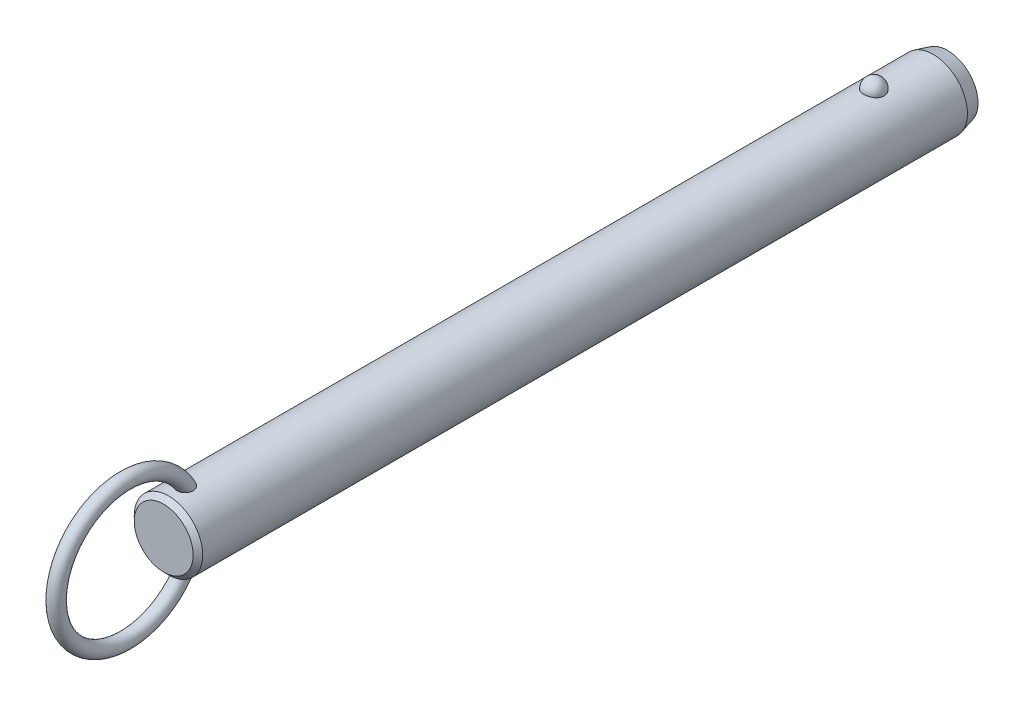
ISO-10303-21;
HEADER;
FILE_DESCRIPTION(('STEP AP214'),'2;1');
FILE_NAME('part.step','',(''),(''),'','','');
FILE_SCHEMA(('AUTOMOTIVE_DESIGN { 1 0 10303 214 1 1 1 1 }'));
ENDSEC;
DATA;
#1=APPLICATION_CONTEXT('core data for automotive mechanical design processes');
#2=APPLICATION_PROTOCOL_DEFINITION('international standard','automotive_design',2000,#1);
#3=PRODUCT_CONTEXT('',#1,'mechanical');
#4=PRODUCT('Part','Part','',(#3));
#5=PRODUCT_RELATED_PRODUCT_CATEGORY('part','',(#4));
#6=PRODUCT_DEFINITION_FORMATION('','',#4);
#7=PRODUCT_DEFINITION_CONTEXT('part definition',#1,'design');
#8=PRODUCT_DEFINITION('design','',#6,#7);
#9=PRODUCT_DEFINITION_SHAPE('','',#8);
#10=(LENGTH_UNIT() NAMED_UNIT(*) SI_UNIT(.MILLI.,.METRE.));
#11=(NAMED_UNIT(*) PLANE_ANGLE_UNIT() SI_UNIT($,.RADIAN.));
#12=(NAMED_UNIT(*) SI_UNIT($,.STERADIAN.) SOLID_ANGLE_UNIT());
#13=UNCERTAINTY_MEASURE_WITH_UNIT(LENGTH_MEASURE(1.E-05),#10,'distance_accuracy_value','');
#14=(GEOMETRIC_REPRESENTATION_CONTEXT(3) GLOBAL_UNCERTAINTY_ASSIGNED_CONTEXT((#13)) GLOBAL_UNIT_ASSIGNED_CONTEXT((#10,
#11,#12)) REPRESENTATION_CONTEXT('',''));
#15=CARTESIAN_POINT('',(0.,0.,0.));
#16=DIRECTION('',(0.,0.,1.));
#17=DIRECTION('',(1.,0.,0.));
#18=AXIS2_PLACEMENT_3D('',#15,#16,#17);
#19=CARTESIAN_POINT('',(0.,0.,137.2));
#20=DIRECTION('',(0.,0.,-1.));
#21=DIRECTION('',(-1.,0.,0.));
#22=AXIS2_PLACEMENT_3D('',#19,#20,#21);
#23=CYLINDRICAL_SURFACE('',#22,7.1);
#24=CARTESIAN_POINT('',(2.0769088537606,6.78943661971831,-2.1));
#25=CARTESIAN_POINT('',(2.07690739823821,6.78943796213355,-1.98268154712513));
#26=CARTESIAN_POINT('',(2.06738130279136,6.79237331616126,-1.86534506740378));
#27=CARTESIAN_POINT('',(2.0295040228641,6.8037853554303,-1.63400788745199));
#28=CARTESIAN_POINT('',(2.00114757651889,6.81226358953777,-1.52000812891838));
#29=CARTESIAN_POINT('',(1.92632025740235,6.83379798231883,-1.29863433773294));
#30=CARTESIAN_POINT('',(1.87985726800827,6.84685214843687,-1.19125744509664));
#31=CARTESIAN_POINT('',(1.76995205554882,6.87608091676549,-0.98604657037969));
#32=CARTESIAN_POINT('',(1.70650980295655,6.8922555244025,-0.88821260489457));
#33=CARTESIAN_POINT('',(1.5638119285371,6.92602930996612,-0.704242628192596));
#34=CARTESIAN_POINT('',(1.4844714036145,6.94363582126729,-0.618173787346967));
#35=CARTESIAN_POINT('',(1.31221746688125,6.97823658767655,-0.460740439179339));
#36=CARTESIAN_POINT('',(1.21930409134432,6.99523084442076,-0.389375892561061));
#37=CARTESIAN_POINT('',(1.02268781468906,7.02666176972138,-0.263547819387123));
#38=CARTESIAN_POINT('',(0.91902009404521,7.04110638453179,-0.209031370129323));
#39=CARTESIAN_POINT('',(0.703548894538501,7.06588726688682,-0.118163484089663));
#40=CARTESIAN_POINT('',(0.591746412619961,7.07622403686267,-0.0818098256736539));
#41=CARTESIAN_POINT('',(0.365557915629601,7.09147068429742,-0.0288711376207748));
#42=CARTESIAN_POINT('',(0.251267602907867,7.09648447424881,-0.0119070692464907));
#43=CARTESIAN_POINT('',(0.0213499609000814,7.10089837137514,0.00304925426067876));
#44=CARTESIAN_POINT('',(-0.0942772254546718,7.10029907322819,0.00104351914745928));
#45=CARTESIAN_POINT('',(-0.321651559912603,7.09360829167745,-0.0216931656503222));
#46=CARTESIAN_POINT('',(-0.433431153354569,7.08760388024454,-0.0421272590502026));
#47=CARTESIAN_POINT('',(-0.651862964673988,7.07086131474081,-0.100729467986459));
#48=CARTESIAN_POINT('',(-0.758515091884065,7.06012307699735,-0.138897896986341));
#49=CARTESIAN_POINT('',(-0.964449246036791,7.03496097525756,-0.232213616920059));
#50=CARTESIAN_POINT('',(-1.06368095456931,7.02051445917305,-0.287465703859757));
#51=CARTESIAN_POINT('',(-1.25145353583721,6.98948740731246,-0.413383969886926));
#52=CARTESIAN_POINT('',(-1.33999321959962,6.97290663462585,-0.48405186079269));
#53=CARTESIAN_POINT('',(-1.50591604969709,6.93898770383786,-0.640594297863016));
#54=CARTESIAN_POINT('',(-1.58302488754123,6.92164094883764,-0.726757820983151));
#55=CARTESIAN_POINT('',(-1.72189320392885,6.8884103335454,-0.91092752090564));
#56=CARTESIAN_POINT('',(-1.78365144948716,6.87252659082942,-1.008934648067));
#57=CARTESIAN_POINT('',(-1.89101272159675,6.84377189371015,-1.21549497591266));
#58=CARTESIAN_POINT('',(-1.93639553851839,6.83094274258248,-1.32416860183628));
#59=CARTESIAN_POINT('',(-2.00874275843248,6.81002070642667,-1.54791500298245));
#60=CARTESIAN_POINT('',(-2.03570774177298,6.80192767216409,-1.66298757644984));
#61=CARTESIAN_POINT('',(-2.07047276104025,6.7914266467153,-1.89571453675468));
#62=CARTESIAN_POINT('',(-2.07835878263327,6.78899315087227,-2.01335491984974));
#63=CARTESIAN_POINT('',(-2.07502083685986,6.79001409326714,-2.24833570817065));
#64=CARTESIAN_POINT('',(-2.06379746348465,6.7934683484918,-2.36567612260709));
#65=CARTESIAN_POINT('',(-2.02263913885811,6.80583442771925,-2.59603194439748));
#66=CARTESIAN_POINT('',(-1.99281127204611,6.81471501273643,-2.70906820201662));
#67=CARTESIAN_POINT('',(-1.91526639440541,6.83691232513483,-2.92836575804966));
#68=CARTESIAN_POINT('',(-1.8675486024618,6.85022924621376,-3.03462676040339));
#69=CARTESIAN_POINT('',(-1.75504492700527,6.87991336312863,-3.23806487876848));
#70=CARTESIAN_POINT('',(-1.69015924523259,6.89629822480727,-3.33518422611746));
#71=CARTESIAN_POINT('',(-1.54505404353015,6.93024852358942,-3.51697105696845));
#72=CARTESIAN_POINT('',(-1.46483385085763,6.94781401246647,-3.60163799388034));
#73=CARTESIAN_POINT('',(-1.29071406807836,6.98225977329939,-3.75654119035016));
#74=CARTESIAN_POINT('',(-1.19675650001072,6.99913673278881,-3.82671308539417));
#75=CARTESIAN_POINT('',(-0.997940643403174,7.03023618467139,-3.9501837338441));
#76=CARTESIAN_POINT('',(-0.89308318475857,7.04445887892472,-4.00348377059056));
#77=CARTESIAN_POINT('',(-0.676902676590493,7.06848365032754,-4.09107242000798));
#78=CARTESIAN_POINT('',(-0.565686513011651,7.0783430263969,-4.12560889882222));
#79=CARTESIAN_POINT('',(-0.338739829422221,7.09282534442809,-4.17575450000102));
#80=CARTESIAN_POINT('',(-0.223009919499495,7.09744899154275,-4.19136617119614));
#81=CARTESIAN_POINT('',(0.00707628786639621,7.10090930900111,-4.20307965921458));
#82=CARTESIAN_POINT('',(0.121410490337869,7.09986531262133,-4.19958377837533));
#83=CARTESIAN_POINT('',(0.347815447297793,7.092380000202,-4.17411564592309));
#84=CARTESIAN_POINT('',(0.459886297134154,7.08593891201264,-4.15214417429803));
#85=CARTESIAN_POINT('',(0.678084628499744,7.06838983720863,-4.09049562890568));
#86=CARTESIAN_POINT('',(0.784237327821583,7.05730369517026,-4.05090137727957));
#87=CARTESIAN_POINT('',(0.988305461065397,7.03163139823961,-3.95511447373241));
#88=CARTESIAN_POINT('',(1.08622031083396,7.01704499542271,-3.89892064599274));
#89=CARTESIAN_POINT('',(1.27284490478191,6.98562668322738,-3.77035541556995));
#90=CARTESIAN_POINT('',(1.36137372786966,6.96876135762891,-3.69772964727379));
#91=CARTESIAN_POINT('',(1.52509486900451,6.93477412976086,-3.53878279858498));
#92=CARTESIAN_POINT('',(1.60028496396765,6.91765218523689,-3.45245943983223));
#93=CARTESIAN_POINT('',(1.73681688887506,6.88465753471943,-3.26658774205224));
#94=CARTESIAN_POINT('',(1.79785966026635,6.86881574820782,-3.16681408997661));
#95=CARTESIAN_POINT('',(1.90265327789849,6.84053157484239,-2.95814408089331));
#96=CARTESIAN_POINT('',(1.94640861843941,6.82808830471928,-2.84925010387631));
#97=CARTESIAN_POINT('',(2.01274378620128,6.80881460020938,-2.63454318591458));
#98=CARTESIAN_POINT('',(2.03676193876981,6.80160856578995,-2.52920574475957));
#99=CARTESIAN_POINT('',(2.06884490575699,6.79191902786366,-2.3159172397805));
#100=CARTESIAN_POINT('',(2.07691019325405,6.78943538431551,-2.20796625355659));
#101=CARTESIAN_POINT('',(2.0769088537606,6.78943661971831,-2.1));
#102=B_SPLINE_CURVE_WITH_KNOTS('',3,(#24,#25,#26,#27,#28,#29,#30,#31,#32,#33,#34,#35,#36,#37,
#38,#39,#40,#41,#42,#43,#44,#45,#46,#47,#48,#49,#50,#51,#52,#53,#54,#55,#56,#57,#58,#59,#60,#61,
#62,#63,#64,#65,#66,#67,#68,#69,#70,#71,#72,#73,#74,#75,#76,#77,#78,#79,#80,#81,#82,#83,#84,#85,
#86,#87,#88,#89,#90,#91,#92,#93,#94,#95,#96,#97,#98,#99,#100,#101),.UNSPECIFIED.,.T.,.F.,(4,2,2,
2,2,2,2,2,2,2,2,2,2,2,2,2,2,2,2,2,2,2,2,2,2,2,2,2,2,2,2,2,2,2,2,2,2,2,4),(0.,0.351568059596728,
0.703234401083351,1.05474780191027,1.40626181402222,1.75970563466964,2.11314851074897,
2.4654696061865,2.81774759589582,3.16301449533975,3.50824481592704,3.84801136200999,
4.18778391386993,4.52968352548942,4.87162112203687,5.22076181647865,5.56993054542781,
5.92363364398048,6.27732559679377,6.62942052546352,6.98150450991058,7.33158042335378,
7.68167162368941,8.03384443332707,8.38603269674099,8.73975272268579,9.09344583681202,
9.44234545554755,9.79119807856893,10.1327344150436,10.4742563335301,10.8141898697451,
11.1541474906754,11.4997793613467,11.8454687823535,12.1979079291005,12.5502553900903,
12.8738073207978,13.1973496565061),.UNSPECIFIED.);
#103=CARTESIAN_POINT('',(2.0769088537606,6.78943661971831,-2.1));
#104=VERTEX_POINT('',#103);
#105=EDGE_CURVE('E41',#104,#104,#102,.T.);
#106=ORIENTED_EDGE('',*,*,#105,.T.);
#107=EDGE_LOOP('',(#106));
#108=FACE_BOUND('',#107,.T.);
#109=CARTESIAN_POINT('',(0.,0.,144.12));
#110=DIRECTION('',(0.,0.,1.));
#111=DIRECTION('',(1.,0.,0.));
#112=AXIS2_PLACEMENT_3D('',#109,#110,#111);
#113=CIRCLE('',#112,7.1);
#114=CARTESIAN_POINT('',(7.1,0.,144.12));
#115=VERTEX_POINT('',#114);
#116=EDGE_CURVE('E10',#115,#115,#113,.F.);
#117=ORIENTED_EDGE('',*,*,#116,.T.);
#118=EDGE_LOOP('',(#117));
#119=FACE_BOUND('',#118,.T.);
#120=CARTESIAN_POINT('',(-0.429539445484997,-7.08699541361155,138.942921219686));
#121=CARTESIAN_POINT('',(-0.508331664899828,-7.08221999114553,138.966876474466));
#122=CARTESIAN_POINT('',(-0.585039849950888,-7.07624016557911,138.997457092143));
#123=CARTESIAN_POINT('',(-0.73208265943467,-7.06254296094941,139.071024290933));
#124=CARTESIAN_POINT('',(-0.802417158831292,-7.05482554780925,139.114011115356));
#125=CARTESIAN_POINT('',(-0.934722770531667,-7.03851844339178,139.211113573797));
#126=CARTESIAN_POINT('',(-0.996700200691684,-7.02992941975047,139.265220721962));
#127=CARTESIAN_POINT('',(-1.11079942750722,-7.01280697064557,139.382967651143));
#128=CARTESIAN_POINT('',(-1.16292136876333,-7.00427354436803,139.446607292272));
#129=CARTESIAN_POINT('',(-1.25705660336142,-6.98799959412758,139.582687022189));
#130=CARTESIAN_POINT('',(-1.29888032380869,-6.98027525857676,139.655259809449));
#131=CARTESIAN_POINT('',(-1.37069920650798,-6.96652886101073,139.806168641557));
#132=CARTESIAN_POINT('',(-1.40069157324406,-6.96050720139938,139.884506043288));
#133=CARTESIAN_POINT('',(-1.45043507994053,-6.95031881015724,140.050190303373));
#134=CARTESIAN_POINT('',(-1.46937115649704,-6.94630231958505,140.137789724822));
#135=CARTESIAN_POINT('',(-1.49424917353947,-6.94099239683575,140.314871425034));
#136=CARTESIAN_POINT('',(-1.50018601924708,-6.93970003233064,140.404354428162));
#137=CARTESIAN_POINT('',(-1.49978214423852,-6.93978815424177,140.594060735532));
#138=CARTESIAN_POINT('',(-1.49187639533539,-6.94150934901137,140.694279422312));
#139=CARTESIAN_POINT('',(-1.46177925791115,-6.94790814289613,140.892479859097));
#140=CARTESIAN_POINT('',(-1.43957541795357,-6.95258831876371,140.990459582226));
#141=CARTESIAN_POINT('',(-1.37783293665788,-6.96510647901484,141.19536292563));
#142=CARTESIAN_POINT('',(-1.33634073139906,-6.97328848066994,141.301680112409));
#143=CARTESIAN_POINT('',(-1.23686994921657,-6.99161706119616,141.506177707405));
#144=CARTESIAN_POINT('',(-1.17889192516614,-7.00176357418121,141.604358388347));
#145=CARTESIAN_POINT('',(-1.0587512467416,-7.02082898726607,141.772374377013));
#146=CARTESIAN_POINT('',(-0.999247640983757,-7.02963746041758,141.844123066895));
#147=CARTESIAN_POINT('',(-0.869494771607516,-7.04686074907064,141.977195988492));
#148=CARTESIAN_POINT('',(-0.799263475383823,-7.05527619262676,142.038537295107));
#149=CARTESIAN_POINT('',(-0.665408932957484,-7.06899457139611,142.135131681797));
#150=CARTESIAN_POINT('',(-0.603817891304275,-7.07457275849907,142.173151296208));
#151=CARTESIAN_POINT('',(-0.475172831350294,-7.08437420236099,142.238758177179));
#152=CARTESIAN_POINT('',(-0.408123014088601,-7.08859848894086,142.266353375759));
#153=CARTESIAN_POINT('',(-0.269431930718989,-7.09522749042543,142.309256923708));
#154=CARTESIAN_POINT('',(-0.197757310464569,-7.09761688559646,142.324461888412));
#155=CARTESIAN_POINT('',(-0.0527849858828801,-7.10017268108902,142.340716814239));
#156=CARTESIAN_POINT('',(0.020511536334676,-7.10034065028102,142.341776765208));
#157=CARTESIAN_POINT('',(0.156426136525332,-7.09855986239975,142.330461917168));
#158=CARTESIAN_POINT('',(0.219199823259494,-7.09688191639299,142.319806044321));
#159=CARTESIAN_POINT('',(0.342134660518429,-7.09201880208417,142.288537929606));
#160=CARTESIAN_POINT('',(0.402295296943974,-7.08883333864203,142.267923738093));
#161=CARTESIAN_POINT('',(0.520687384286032,-7.08113868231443,142.217212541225));
#162=CARTESIAN_POINT('',(0.578791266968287,-7.07658958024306,142.186827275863));
#163=CARTESIAN_POINT('',(0.69017323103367,-7.06659708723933,142.118367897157));
#164=CARTESIAN_POINT('',(0.743447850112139,-7.061153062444,142.080288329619));
#165=CARTESIAN_POINT('',(0.87094790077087,-7.04680292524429,141.976592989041));
#166=CARTESIAN_POINT('',(0.941828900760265,-7.03755800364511,141.906897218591));
#167=CARTESIAN_POINT('',(1.07136606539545,-7.01900793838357,141.756945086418));
#168=CARTESIAN_POINT('',(1.13000013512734,-7.00970271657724,141.676670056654));
#169=CARTESIAN_POINT('',(1.23579584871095,-6.99183327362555,141.506899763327));
#170=CARTESIAN_POINT('',(1.28274271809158,-6.98328455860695,141.417269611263));
#171=CARTESIAN_POINT('',(1.3635144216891,-6.96796352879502,141.232176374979));
#172=CARTESIAN_POINT('',(1.39733971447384,-6.96119115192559,141.136713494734));
#173=CARTESIAN_POINT('',(1.45579181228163,-6.94922464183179,140.92530928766));
#174=CARTESIAN_POINT('',(1.47790145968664,-6.94449000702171,140.808631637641));
#175=CARTESIAN_POINT('',(1.50168752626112,-6.93938731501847,140.573015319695));
#176=CARTESIAN_POINT('',(1.50336085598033,-6.93901991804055,140.45407631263));
#177=CARTESIAN_POINT('',(1.48486516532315,-6.9430010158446,140.22360799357));
#178=CARTESIAN_POINT('',(1.46573441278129,-6.9471253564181,140.111995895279));
#179=CARTESIAN_POINT('',(1.40606892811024,-6.95944667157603,139.894886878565));
#180=CARTESIAN_POINT('',(1.36556446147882,-6.96763788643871,139.7893815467));
#181=CARTESIAN_POINT('',(1.2708270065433,-6.98548038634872,139.604287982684));
#182=CARTESIAN_POINT('',(1.21949810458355,-6.99473841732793,139.523171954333));
#183=CARTESIAN_POINT('',(1.10242050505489,-7.0141406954,139.372227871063));
#184=CARTESIAN_POINT('',(1.03668119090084,-7.02428436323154,139.30239252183));
#185=CARTESIAN_POINT('',(0.900559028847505,-7.04295285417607,139.183573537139));
#186=CARTESIAN_POINT('',(0.831428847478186,-7.05153466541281,139.133157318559));
#187=CARTESIAN_POINT('',(0.685291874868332,-7.06723150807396,139.045142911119));
#188=CARTESIAN_POINT('',(0.608287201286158,-7.07434693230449,139.007541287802));
#189=CARTESIAN_POINT('',(0.451878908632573,-7.08602232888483,138.947491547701));
#190=CARTESIAN_POINT('',(0.372686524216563,-7.09067127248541,138.924508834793));
#191=CARTESIAN_POINT('',(0.211477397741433,-7.09730788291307,138.892035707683));
#192=CARTESIAN_POINT('',(0.129460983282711,-7.09929585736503,138.88254373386));
#193=CARTESIAN_POINT('',(-0.0332905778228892,-7.10037858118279,138.877351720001));
#194=CARTESIAN_POINT('',(-0.114016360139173,-7.09953334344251,138.881365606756));
#195=CARTESIAN_POINT('',(-0.27367033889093,-7.09517338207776,138.902454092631));
#196=CARTESIAN_POINT('',(-0.352598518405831,-7.09165863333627,138.919528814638));
#197=CARTESIAN_POINT('',(-0.429539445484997,-7.08699541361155,138.942921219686));
#198=B_SPLINE_CURVE_WITH_KNOTS('',3,(#120,#121,#122,#123,#124,#125,#126,#127,#128,#129,#130,
#131,#132,#133,#134,#135,#136,#137,#138,#139,#140,#141,#142,#143,#144,#145,#146,#147,#148,#149,
#150,#151,#152,#153,#154,#155,#156,#157,#158,#159,#160,#161,#162,#163,#164,#165,#166,#167,#168,
#169,#170,#171,#172,#173,#174,#175,#176,#177,#178,#179,#180,#181,#182,#183,#184,#185,#186,#187,
#188,#189,#190,#191,#192,#193,#194,#195,#196,#197),.UNSPECIFIED.,.T.,.F.,(4,2,2,2,2,2,2,2,2,2,2,
2,2,2,2,2,2,2,2,2,2,2,2,2,2,2,2,2,2,2,2,2,2,2,2,2,2,2,4),(0.,0.247183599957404,
0.494372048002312,0.741372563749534,0.988369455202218,1.23962059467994,1.490931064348,
1.75897818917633,2.02713035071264,2.3275826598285,2.62829697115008,2.97008736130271,
3.31186629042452,3.59175319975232,3.87117637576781,4.08813841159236,4.30493502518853,
4.5235225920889,4.74195577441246,4.93215328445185,5.12238804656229,5.318848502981,
5.51544871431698,5.81332317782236,6.11173048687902,6.41527266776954,6.71880423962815,
7.07358156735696,7.42841252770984,7.76631485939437,8.10373999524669,8.39142246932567,
8.67891817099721,8.93560332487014,9.19221962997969,9.43881106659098,9.68537399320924,
9.92674752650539,10.1681233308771),.UNSPECIFIED.);
#199=CARTESIAN_POINT('',(-0.429539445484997,-7.08699541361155,138.942921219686));
#200=VERTEX_POINT('',#199);
#201=EDGE_CURVE('E59',#200,#200,#198,.T.);
#202=ORIENTED_EDGE('',*,*,#201,.T.);
#203=EDGE_LOOP('',(#202));
#204=FACE_BOUND('',#203,.T.);
#205=CARTESIAN_POINT('',(-0.429539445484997,7.08699541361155,138.942921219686));
#206=CARTESIAN_POINT('',(-0.351665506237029,7.09171429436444,138.919246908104));
#207=CARTESIAN_POINT('',(-0.271733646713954,7.09525896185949,138.902036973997));
#208=CARTESIAN_POINT('',(-0.110026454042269,7.09960839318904,138.881005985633));
#209=CARTESIAN_POINT('',(-0.0282502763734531,7.10041187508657,138.877191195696));
#210=CARTESIAN_POINT('',(0.134782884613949,7.09918849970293,138.883059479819));
#211=CARTESIAN_POINT('',(0.216039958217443,7.09716214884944,138.89274013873));
#212=CARTESIAN_POINT('',(0.375730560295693,7.09050177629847,138.925347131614));
#213=CARTESIAN_POINT('',(0.454164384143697,7.08586802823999,138.948272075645));
#214=CARTESIAN_POINT('',(0.606025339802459,7.07449911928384,139.006771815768));
#215=CARTESIAN_POINT('',(0.679451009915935,7.06776334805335,139.042350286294));
#216=CARTESIAN_POINT('',(0.81923414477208,7.05292866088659,139.125175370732));
#217=CARTESIAN_POINT('',(0.885591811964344,7.04482978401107,139.172421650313));
#218=CARTESIAN_POINT('',(1.00993211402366,7.02808709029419,139.277590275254));
#219=CARTESIAN_POINT('',(1.06785399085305,7.01943990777,139.335583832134));
#220=CARTESIAN_POINT('',(1.17342527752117,7.00256662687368,139.460301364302));
#221=CARTESIAN_POINT('',(1.22107408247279,6.99434055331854,139.527025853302));
#222=CARTESIAN_POINT('',(1.30652927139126,6.97889183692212,139.669362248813));
#223=CARTESIAN_POINT('',(1.34399711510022,6.97170674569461,139.745180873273));
#224=CARTESIAN_POINT('',(1.40682616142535,6.95930080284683,139.901810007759));
#225=CARTESIAN_POINT('',(1.43218374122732,6.95408053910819,139.98262200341));
#226=CARTESIAN_POINT('',(1.47246409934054,6.94566853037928,140.153531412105));
#227=CARTESIAN_POINT('',(1.48642590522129,6.9426653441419,140.24386307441));
#228=CARTESIAN_POINT('',(1.5011410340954,6.93949744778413,140.425619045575));
#229=CARTESIAN_POINT('',(1.50188917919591,6.93933385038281,140.517043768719));
#230=CARTESIAN_POINT('',(1.49030464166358,6.94183245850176,140.71084381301));
#231=CARTESIAN_POINT('',(1.47627413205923,6.94486147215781,140.813112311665));
#232=CARTESIAN_POINT('',(1.43356351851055,6.95380194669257,141.014471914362));
#233=CARTESIAN_POINT('',(1.4048676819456,6.95971650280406,141.113559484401));
#234=CARTESIAN_POINT('',(1.32908750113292,6.97461208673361,141.318908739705));
#235=CARTESIAN_POINT('',(1.28011435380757,6.98388945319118,141.424456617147));
#236=CARTESIAN_POINT('',(1.16520357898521,7.00397743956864,141.625760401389));
#237=CARTESIAN_POINT('',(1.09927694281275,7.01478706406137,141.721522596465));
#238=CARTESIAN_POINT('',(0.969361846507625,7.03373936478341,141.876756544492));
#239=CARTESIAN_POINT('',(0.909042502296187,7.04187023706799,141.939303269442));
#240=CARTESIAN_POINT('',(0.779178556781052,7.05741732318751,142.054053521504));
#241=CARTESIAN_POINT('',(0.709649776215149,7.06483472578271,142.106274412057));
#242=CARTESIAN_POINT('',(0.576854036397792,7.0767751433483,142.188113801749));
#243=CARTESIAN_POINT('',(0.515118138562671,7.08158033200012,142.220164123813));
#244=CARTESIAN_POINT('',(0.387127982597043,7.08972701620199,142.273765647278));
#245=CARTESIAN_POINT('',(0.320877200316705,7.09306962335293,142.295324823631));
#246=CARTESIAN_POINT('',(0.185041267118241,7.09791507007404,142.326400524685));
#247=CARTESIAN_POINT('',(0.115437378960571,7.09940591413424,142.335838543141));
#248=CARTESIAN_POINT('',(-0.024315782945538,7.10030171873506,142.341522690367));
#249=CARTESIAN_POINT('',(-0.0944648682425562,7.0997073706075,142.337773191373));
#250=CARTESIAN_POINT('',(-0.225713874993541,7.09668414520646,142.318508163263));
#251=CARTESIAN_POINT('',(-0.287006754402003,7.09444865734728,142.304232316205));
#252=CARTESIAN_POINT('',(-0.406555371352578,7.08860360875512,142.266368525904));
#253=CARTESIAN_POINT('',(-0.464809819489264,7.08499346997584,142.242776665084));
#254=CARTESIAN_POINT('',(-0.594955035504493,7.07541654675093,142.178923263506));
#255=CARTESIAN_POINT('',(-0.665389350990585,7.06906574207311,142.135753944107));
#256=CARTESIAN_POINT('',(-0.798242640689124,7.05530261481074,142.038587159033));
#257=CARTESIAN_POINT('',(-0.860645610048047,7.0478882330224,141.984568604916));
#258=CARTESIAN_POINT('',(-0.994249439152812,7.03045217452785,141.850996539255));
#259=CARTESIAN_POINT('',(-1.06260129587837,7.02030745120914,141.768614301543));
#260=CARTESIAN_POINT('',(-1.18502045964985,7.00068382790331,141.593843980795));
#261=CARTESIAN_POINT('',(-1.23907684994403,6.99120544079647,141.501448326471));
#262=CARTESIAN_POINT('',(-1.33335589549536,6.97384343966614,141.308008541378));
#263=CARTESIAN_POINT('',(-1.37336138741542,6.96598557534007,141.206856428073));
#264=CARTESIAN_POINT('',(-1.43770677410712,6.95299053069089,140.999504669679));
#265=CARTESIAN_POINT('',(-1.46204473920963,6.94785368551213,140.89330440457));
#266=CARTESIAN_POINT('',(-1.49537533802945,6.94076296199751,140.668231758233));
#267=CARTESIAN_POINT('',(-1.50273564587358,6.93914842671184,140.54909751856));
#268=CARTESIAN_POINT('',(-1.4954555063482,6.94072368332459,140.311470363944));
#269=CARTESIAN_POINT('',(-1.48082914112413,6.94391040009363,140.192977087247));
#270=CARTESIAN_POINT('',(-1.43076401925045,6.95438579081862,139.973432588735));
#271=CARTESIAN_POINT('',(-1.39762227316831,6.96121852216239,139.871841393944));
#272=CARTESIAN_POINT('',(-1.31211274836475,6.97783941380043,139.677351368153));
#273=CARTESIAN_POINT('',(-1.25976607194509,6.98762432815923,139.58444313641));
#274=CARTESIAN_POINT('',(-1.14583073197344,7.00713153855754,139.424160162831));
#275=CARTESIAN_POINT('',(-1.08665947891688,7.01665982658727,139.355035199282));
#276=CARTESIAN_POINT('',(-0.956606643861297,7.03556646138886,139.228878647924));
#277=CARTESIAN_POINT('',(-0.885737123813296,7.04494495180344,139.171834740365));
#278=CARTESIAN_POINT('',(-0.751558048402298,7.06035735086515,139.083100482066));
#279=CARTESIAN_POINT('',(-0.69012057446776,7.0666695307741,139.048593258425));
#280=CARTESIAN_POINT('',(-0.562815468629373,7.07794609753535,138.988750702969));
#281=CARTESIAN_POINT('',(-0.496948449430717,7.08291067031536,138.963414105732));
#282=CARTESIAN_POINT('',(-0.429539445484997,7.08699541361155,138.942921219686));
#283=B_SPLINE_CURVE_WITH_KNOTS('',3,(#205,#206,#207,#208,#209,#210,#211,#212,#213,#214,#215,
#216,#217,#218,#219,#220,#221,#222,#223,#224,#225,#226,#227,#228,#229,#230,#231,#232,#233,#234,
#235,#236,#237,#238,#239,#240,#241,#242,#243,#244,#245,#246,#247,#248,#249,#250,#251,#252,#253,
#254,#255,#256,#257,#258,#259,#260,#261,#262,#263,#264,#265,#266,#267,#268,#269,#270,#271,#272,
#273,#274,#275,#276,#277,#278,#279,#280,#281,#282),.UNSPECIFIED.,.T.,.F.,(4,2,2,2,2,2,2,2,2,2,2,
2,2,2,2,2,2,2,2,2,2,2,2,2,2,2,2,2,2,2,2,2,2,2,2,2,2,2,4),(0.,0.244335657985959,
0.488785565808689,0.733191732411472,0.977572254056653,1.22202379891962,1.46646834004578,
1.71259457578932,1.9587352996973,2.21226768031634,2.46587585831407,2.73913816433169,
3.01250754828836,3.32109936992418,3.63002293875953,3.9786351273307,4.32702187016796,
4.58793945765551,4.84841449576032,5.05676704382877,5.26496096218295,5.47449661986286,
5.68396281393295,5.87205447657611,6.06022532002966,6.30743751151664,6.55513496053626,
6.87602468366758,7.19715875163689,7.5230577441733,7.84899686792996,8.20516155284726,
8.56109821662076,8.88040084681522,9.19935367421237,9.47236282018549,9.74509220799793,
9.95662250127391,10.1681235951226),.UNSPECIFIED.);
#284=CARTESIAN_POINT('',(-0.429539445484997,7.08699541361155,138.942921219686));
#285=VERTEX_POINT('',#284);
#286=EDGE_CURVE('E67',#285,#285,#283,.T.);
#287=ORIENTED_EDGE('',*,*,#286,.T.);
#288=EDGE_LOOP('',(#287));
#289=FACE_BOUND('',#288,.T.);
#290=CARTESIAN_POINT('',(0.,0.,-14.4));
#291=DIRECTION('',(0.,0.,-1.));
#292=DIRECTION('',(-1.,0.,0.));
#293=AXIS2_PLACEMENT_3D('',#290,#291,#292);
#294=CIRCLE('',#293,7.1);
#295=CARTESIAN_POINT('',(-7.1,0.,-14.4));
#296=VERTEX_POINT('',#295);
#297=EDGE_CURVE('E56',#296,#296,#294,.F.);
#298=ORIENTED_EDGE('',*,*,#297,.T.);
#299=EDGE_LOOP('',(#298));
#300=FACE_BOUND('',#299,.T.);
#301=ADVANCED_FACE('F37',(#108,#119,#204,#289,#300),#23,.T.);
#302=CARTESIAN_POINT('',(0.,0.,-17.4));
#303=DIRECTION('',(0.,0.,-1.));
#304=DIRECTION('',(-1.,0.,0.));
#305=AXIS2_PLACEMENT_3D('',#302,#303,#304);
#306=PLANE('',#305);
#307=CARTESIAN_POINT('',(0.,0.,-17.4));
#308=DIRECTION('',(0.,0.,-1.));
#309=DIRECTION('',(-1.,0.,0.));
#310=AXIS2_PLACEMENT_3D('',#307,#308,#309);
#311=CIRCLE('',#310,6.29615242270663);
#312=CARTESIAN_POINT('',(-6.29615242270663,0.,-17.4));
#313=VERTEX_POINT('',#312);
#314=EDGE_CURVE('E66',#313,#313,#311,.T.);
#315=ORIENTED_EDGE('',*,*,#314,.T.);
#316=EDGE_LOOP('',(#315));
#317=FACE_BOUND('',#316,.T.);
#318=ADVANCED_FACE('F85',(#317),#306,.T.);
#319=CARTESIAN_POINT('',(0.,0.,-17.4));
#320=DIRECTION('',(0.,0.,1.));
#321=DIRECTION('',(1.,0.,0.));
#322=AXIS2_PLACEMENT_3D('',#319,#320,#321);
#323=CONICAL_SURFACE('',#322,6.29615242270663,0.261799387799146);
#324=ORIENTED_EDGE('',*,*,#297,.F.);
#325=EDGE_LOOP('',(#324));
#326=FACE_BOUND('',#325,.T.);
#327=ORIENTED_EDGE('',*,*,#314,.F.);
#328=EDGE_LOOP('',(#327));
#329=FACE_BOUND('',#328,.T.);
#330=ADVANCED_FACE('F83',(#326,#329),#323,.T.);
#331=CARTESIAN_POINT('',(0.,0.,145.12));
#332=DIRECTION('',(0.,0.,1.));
#333=DIRECTION('',(1.,0.,0.));
#334=AXIS2_PLACEMENT_3D('',#331,#332,#333);
#335=PLANE('',#334);
#336=CARTESIAN_POINT('',(0.,0.,145.12));
#337=DIRECTION('',(0.,0.,1.));
#338=DIRECTION('',(1.,0.,0.));
#339=AXIS2_PLACEMENT_3D('',#336,#337,#338);
#340=CIRCLE('',#339,6.09999999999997);
#341=CARTESIAN_POINT('',(6.09999999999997,0.,145.12));
#342=VERTEX_POINT('',#341);
#343=EDGE_CURVE('E50',#342,#342,#340,.T.);
#344=ORIENTED_EDGE('',*,*,#343,.T.);
#345=EDGE_LOOP('',(#344));
#346=FACE_BOUND('',#345,.T.);
#347=ADVANCED_FACE('F77',(#346),#335,.T.);
#348=CARTESIAN_POINT('',(0.,0.,153.05));
#349=DIRECTION('',(1.,0.,0.));
#350=DIRECTION('',(0.,0.,-1.));
#351=AXIS2_PLACEMENT_3D('',#348,#349,#350);
#352=TOROIDAL_SURFACE('',#351,14.35,1.5);
#353=ORIENTED_EDGE('',*,*,#286,.F.);
#354=EDGE_LOOP('',(#353));
#355=FACE_BOUND('',#354,.T.);
#356=ORIENTED_EDGE('',*,*,#201,.F.);
#357=EDGE_LOOP('',(#356));
#358=FACE_BOUND('',#357,.T.);
#359=ADVANCED_FACE('F73',(#355,#358),#352,.T.);
#360=CARTESIAN_POINT('',(0.,0.,145.12));
#361=DIRECTION('',(0.,0.,-1.));
#362=DIRECTION('',(-1.,0.,0.));
#363=AXIS2_PLACEMENT_3D('',#360,#361,#362);
#364=CONICAL_SURFACE('',#363,6.09999999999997,0.78539816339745);
#365=ORIENTED_EDGE('',*,*,#116,.F.);
#366=EDGE_LOOP('',(#365));
#367=FACE_BOUND('',#366,.T.);
#368=ORIENTED_EDGE('',*,*,#343,.F.);
#369=EDGE_LOOP('',(#368));
#370=FACE_BOUND('',#369,.T.);
#371=ADVANCED_FACE('F39',(#367,#370),#364,.T.);
#372=CARTESIAN_POINT('',(0.,7.1,-2.1));
#373=DIRECTION('',(0.,1.,0.));
#374=DIRECTION('',(0.,0.,1.));
#375=AXIS2_PLACEMENT_3D('',#372,#373,#374);
#376=SPHERICAL_SURFACE('',#375,2.10000000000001);
#377=ORIENTED_EDGE('',*,*,#105,.F.);
#378=EDGE_LOOP('',(#377));
#379=FACE_BOUND('',#378,.T.);
#380=ADVANCED_FACE('F79',(#379),#376,.T.);
#381=CLOSED_SHELL('',(#301,#318,#330,#347,#359,#371,#380));
#382=MANIFOLD_SOLID_BREP('B2',#381);
#383=ADVANCED_BREP_SHAPE_REPRESENTATION('',(#18,#382),#14);
#384=SHAPE_DEFINITION_REPRESENTATION(#9,#383);
ENDSEC;
END-ISO-10303-21;
